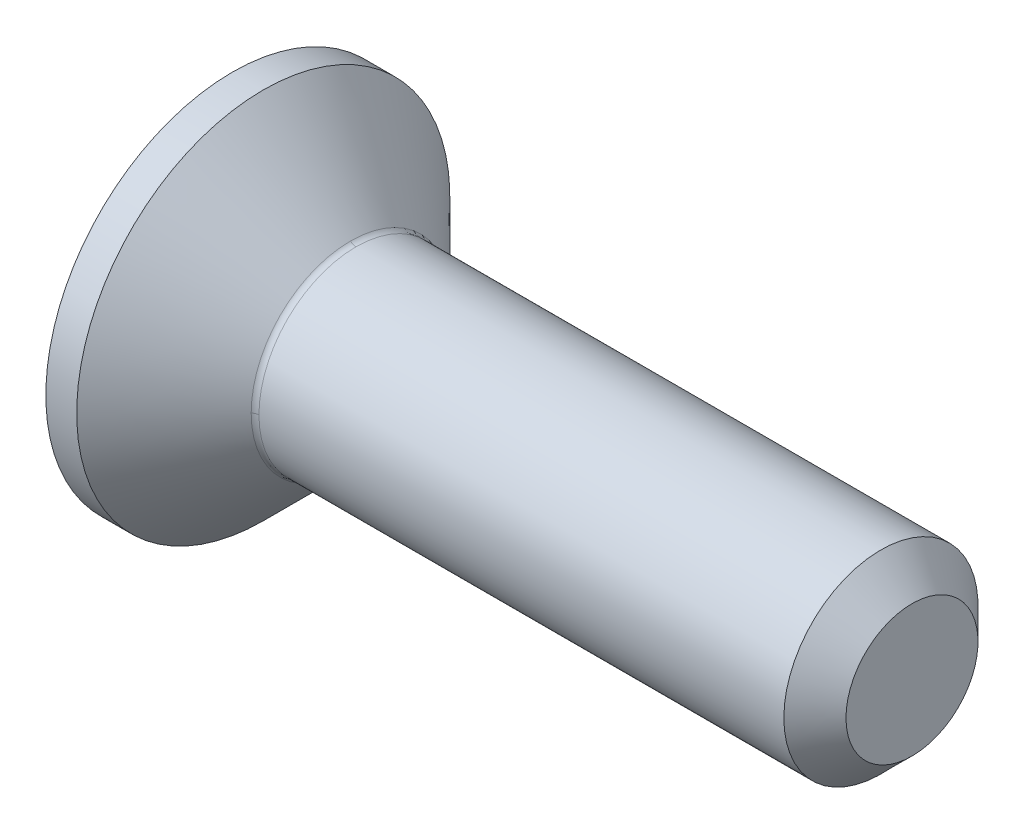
ISO-10303-21;
HEADER;
FILE_DESCRIPTION(('STEP AP214'),'2;1');
FILE_NAME('part.step','',(''),(''),'','','');
FILE_SCHEMA(('AUTOMOTIVE_DESIGN { 1 0 10303 214 1 1 1 1 }'));
ENDSEC;
DATA;
#1=APPLICATION_CONTEXT('core data for automotive mechanical design processes');
#2=APPLICATION_PROTOCOL_DEFINITION('international standard','automotive_design',2000,#1);
#3=PRODUCT_CONTEXT('',#1,'mechanical');
#4=PRODUCT('Part','Part','',(#3));
#5=PRODUCT_RELATED_PRODUCT_CATEGORY('part','',(#4));
#6=PRODUCT_DEFINITION_FORMATION('','',#4);
#7=PRODUCT_DEFINITION_CONTEXT('part definition',#1,'design');
#8=PRODUCT_DEFINITION('design','',#6,#7);
#9=PRODUCT_DEFINITION_SHAPE('','',#8);
#10=(LENGTH_UNIT() NAMED_UNIT(*) SI_UNIT(.MILLI.,.METRE.));
#11=(NAMED_UNIT(*) PLANE_ANGLE_UNIT() SI_UNIT($,.RADIAN.));
#12=(NAMED_UNIT(*) SI_UNIT($,.STERADIAN.) SOLID_ANGLE_UNIT());
#13=UNCERTAINTY_MEASURE_WITH_UNIT(LENGTH_MEASURE(1.E-05),#10,'distance_accuracy_value','');
#14=(GEOMETRIC_REPRESENTATION_CONTEXT(3) GLOBAL_UNCERTAINTY_ASSIGNED_CONTEXT((#13)) GLOBAL_UNIT_ASSIGNED_CONTEXT((#10,
#11,#12)) REPRESENTATION_CONTEXT('',''));
#15=CARTESIAN_POINT('',(0.,0.,0.));
#16=DIRECTION('',(0.,0.,1.));
#17=DIRECTION('',(1.,0.,0.));
#18=AXIS2_PLACEMENT_3D('',#15,#16,#17);
#19=CARTESIAN_POINT('',(34.170556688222,0.200123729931,0.299374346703));
#20=DIRECTION('',(1.,0.,0.));
#21=DIRECTION('',(0.,1.,0.));
#22=AXIS2_PLACEMENT_3D('',#19,#20,#21);
#23=PLANE('',#22);
#24=CARTESIAN_POINT('',(34.170556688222,0.200123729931,0.299374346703));
#25=DIRECTION('',(1.,0.,0.));
#26=DIRECTION('',(0.,0.,1.));
#27=AXIS2_PLACEMENT_3D('',#24,#25,#26);
#28=CIRCLE('',#27,3.4);
#29=CARTESIAN_POINT('',(34.170556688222,0.200123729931,3.699374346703));
#30=VERTEX_POINT('',#29);
#31=EDGE_CURVE('E10',#30,#30,#28,.T.);
#32=ORIENTED_EDGE('',*,*,#31,.T.);
#33=EDGE_LOOP('',(#32));
#34=FACE_BOUND('',#33,.T.);
#35=ADVANCED_FACE('F16',(#34),#23,.T.);
#36=CARTESIAN_POINT('',(33.370556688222,0.200123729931,0.299374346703));
#37=DIRECTION('',(-1.,0.,0.));
#38=DIRECTION('',(0.,0.,-1.));
#39=AXIS2_PLACEMENT_3D('',#36,#37,#38);
#40=CONICAL_SURFACE('',#39,4.2,0.785398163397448);
#41=ORIENTED_EDGE('',*,*,#31,.F.);
#42=EDGE_LOOP('',(#41));
#43=FACE_BOUND('',#42,.T.);
#44=CARTESIAN_POINT('',(32.570556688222,0.200123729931,0.299374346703));
#45=DIRECTION('',(1.,0.,0.));
#46=DIRECTION('',(0.,0.,1.));
#47=AXIS2_PLACEMENT_3D('',#44,#45,#46);
#48=CIRCLE('',#47,5.);
#49=CARTESIAN_POINT('',(32.570556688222,0.200123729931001,5.299374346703));
#50=VERTEX_POINT('',#49);
#51=EDGE_CURVE('E26',#50,#50,#48,.T.);
#52=ORIENTED_EDGE('',*,*,#51,.T.);
#53=EDGE_LOOP('',(#52));
#54=FACE_BOUND('',#53,.T.);
#55=ADVANCED_FACE('F326',(#43,#54),#40,.T.);
#56=CARTESIAN_POINT('',(-0.829443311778,0.200123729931,0.299374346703));
#57=DIRECTION('',(1.,0.,0.));
#58=DIRECTION('',(0.,0.,1.));
#59=AXIS2_PLACEMENT_3D('',#56,#57,#58);
#60=CYLINDRICAL_SURFACE('',#59,5.);
#61=CARTESIAN_POINT('',(5.53624211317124,0.200123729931,0.299374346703));
#62=DIRECTION('',(-1.,0.,0.));
#63=DIRECTION('',(0.,1.,0.));
#64=AXIS2_PLACEMENT_3D('',#61,#62,#63);
#65=CIRCLE('',#64,5.);
#66=CARTESIAN_POINT('',(5.53624211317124,0.200123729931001,5.299374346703));
#67=VERTEX_POINT('',#66);
#68=CARTESIAN_POINT('',(5.53624211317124,5.200123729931,0.299374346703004));
#69=VERTEX_POINT('',#68);
#70=EDGE_CURVE('E115',#67,#69,#65,.T.);
#71=ORIENTED_EDGE('',*,*,#70,.F.);
#72=CARTESIAN_POINT('',(5.53624211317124,0.200123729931,0.299374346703));
#73=DIRECTION('',(-1.,0.,0.));
#74=DIRECTION('',(0.,0.,1.));
#75=AXIS2_PLACEMENT_3D('',#72,#73,#74);
#76=CIRCLE('',#75,5.);
#77=EDGE_CURVE('E100',#69,#67,#76,.T.);
#78=ORIENTED_EDGE('',*,*,#77,.F.);
#79=EDGE_LOOP('',(#71,#78));
#80=FACE_BOUND('',#79,.T.);
#81=ORIENTED_EDGE('',*,*,#51,.F.);
#82=EDGE_LOOP('',(#81));
#83=FACE_BOUND('',#82,.T.);
#84=ADVANCED_FACE('F121',(#80,#83),#60,.T.);
#85=CARTESIAN_POINT('',(5.53624211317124,0.200123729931,0.299374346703));
#86=DIRECTION('',(1.,0.,0.));
#87=DIRECTION('',(0.,0.159318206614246,0.987227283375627));
#88=AXIS2_PLACEMENT_3D('',#85,#86,#87);
#89=TOROIDAL_SURFACE('',#88,5.4,0.4);
#90=ORIENTED_EDGE('',*,*,#77,.T.);
#91=CARTESIAN_POINT('',(5.53624211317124,0.200123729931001,5.699374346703));
#92=DIRECTION('',(0.,1.,0.));
#93=DIRECTION('',(0.,0.,-1.));
#94=AXIS2_PLACEMENT_3D('',#91,#92,#93);
#95=CIRCLE('',#94,0.4);
#96=CARTESIAN_POINT('',(5.25339940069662,0.200123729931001,5.41653163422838));
#97=VERTEX_POINT('',#96);
#98=EDGE_CURVE('E104',#67,#97,#95,.T.);
#99=ORIENTED_EDGE('',*,*,#98,.T.);
#100=CARTESIAN_POINT('',(5.25339940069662,0.200123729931,0.299374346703));
#101=DIRECTION('',(-1.,0.,0.));
#102=DIRECTION('',(0.,0.,1.));
#103=AXIS2_PLACEMENT_3D('',#100,#101,#102);
#104=CIRCLE('',#103,5.11715728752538);
#105=CARTESIAN_POINT('',(5.25339940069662,5.31728101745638,0.299374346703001));
#106=VERTEX_POINT('',#105);
#107=EDGE_CURVE('E131',#106,#97,#104,.T.);
#108=ORIENTED_EDGE('',*,*,#107,.F.);
#109=CARTESIAN_POINT('',(5.53624211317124,5.600123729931,0.299374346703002));
#110=DIRECTION('',(0.,0.,-1.));
#111=DIRECTION('',(0.,-1.,0.));
#112=AXIS2_PLACEMENT_3D('',#109,#110,#111);
#113=CIRCLE('',#112,0.4);
#114=EDGE_CURVE('E107',#69,#106,#113,.T.);
#115=ORIENTED_EDGE('',*,*,#114,.F.);
#116=EDGE_LOOP('',(#90,#99,#108,#115));
#117=FACE_BOUND('',#116,.T.);
#118=ADVANCED_FACE('F102',(#117),#89,.F.);
#119=CARTESIAN_POINT('',(5.53624211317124,0.200123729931,0.299374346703));
#120=DIRECTION('',(1.,0.,0.));
#121=DIRECTION('',(0.,0.987227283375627,-0.159318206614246));
#122=AXIS2_PLACEMENT_3D('',#119,#120,#121);
#123=TOROIDAL_SURFACE('',#122,5.4,0.4);
#124=ORIENTED_EDGE('',*,*,#70,.T.);
#125=ORIENTED_EDGE('',*,*,#114,.T.);
#126=CARTESIAN_POINT('',(5.25339940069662,0.200123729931,0.299374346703));
#127=DIRECTION('',(-1.,0.,0.));
#128=DIRECTION('',(0.,1.,0.));
#129=AXIS2_PLACEMENT_3D('',#126,#127,#128);
#130=CIRCLE('',#129,5.11715728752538);
#131=EDGE_CURVE('E117',#97,#106,#130,.T.);
#132=ORIENTED_EDGE('',*,*,#131,.F.);
#133=ORIENTED_EDGE('',*,*,#98,.F.);
#134=EDGE_LOOP('',(#124,#125,#132,#133));
#135=FACE_BOUND('',#134,.T.);
#136=ADVANCED_FACE('F114',(#135),#123,.F.);
#137=CARTESIAN_POINT('',(3.00697804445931,0.200123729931,0.299374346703));
#138=DIRECTION('',(-1.,0.,0.));
#139=DIRECTION('',(0.,-1.,0.));
#140=AXIS2_PLACEMENT_3D('',#137,#138,#139);
#141=CONICAL_SURFACE('',#140,7.36357864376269,0.785398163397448);
#142=ORIENTED_EDGE('',*,*,#107,.T.);
#143=ORIENTED_EDGE('',*,*,#131,.T.);
#144=EDGE_LOOP('',(#142,#143));
#145=FACE_BOUND('',#144,.T.);
#146=CARTESIAN_POINT('',(0.760556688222,0.200123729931,0.299374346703));
#147=DIRECTION('',(1.,0.,0.));
#148=DIRECTION('',(0.,1.,0.));
#149=AXIS2_PLACEMENT_3D('',#146,#147,#148);
#150=CIRCLE('',#149,9.61);
#151=CARTESIAN_POINT('',(0.760556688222,9.810123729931,0.299374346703));
#152=VERTEX_POINT('',#151);
#153=EDGE_CURVE('E173',#152,#152,#150,.T.);
#154=ORIENTED_EDGE('',*,*,#153,.T.);
#155=EDGE_LOOP('',(#154));
#156=FACE_BOUND('',#155,.T.);
#157=ADVANCED_FACE('F18',(#145,#156),#141,.T.);
#158=CARTESIAN_POINT('',(-0.829443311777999,0.200123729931,0.299374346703));
#159=DIRECTION('',(1.,0.,0.));
#160=DIRECTION('',(0.,1.,0.));
#161=AXIS2_PLACEMENT_3D('',#158,#159,#160);
#162=CYLINDRICAL_SURFACE('',#161,9.61);
#163=ORIENTED_EDGE('',*,*,#153,.F.);
#164=EDGE_LOOP('',(#163));
#165=FACE_BOUND('',#164,.T.);
#166=CARTESIAN_POINT('',(-0.829443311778,0.200123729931,0.299374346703));
#167=DIRECTION('',(1.,0.,0.));
#168=DIRECTION('',(0.,1.,0.));
#169=AXIS2_PLACEMENT_3D('',#166,#167,#168);
#170=CIRCLE('',#169,9.61);
#171=CARTESIAN_POINT('',(-0.829443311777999,9.810123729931,0.299374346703));
#172=VERTEX_POINT('',#171);
#173=EDGE_CURVE('E204',#172,#172,#170,.T.);
#174=ORIENTED_EDGE('',*,*,#173,.T.);
#175=EDGE_LOOP('',(#174));
#176=FACE_BOUND('',#175,.T.);
#177=ADVANCED_FACE('F335',(#165,#176),#162,.T.);
#178=CARTESIAN_POINT('',(-0.829443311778,-1.53192707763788,3.299374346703));
#179=DIRECTION('',(0.,-0.866025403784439,0.5));
#180=DIRECTION('',(-1.,0.,0.));
#181=AXIS2_PLACEMENT_3D('',#178,#179,#180);
#182=PLANE('',#181);
#183=CARTESIAN_POINT('',(2.77055668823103,-1.53192707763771,3.29937434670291));
#184=CARTESIAN_POINT('',(2.7795340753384,-1.54747645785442,3.27244203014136));
#185=CARTESIAN_POINT('',(2.79716354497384,-1.57863959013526,3.21846590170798));
#186=CARTESIAN_POINT('',(2.8225701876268,-1.62557234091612,3.13717599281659));
#187=CARTESIAN_POINT('',(2.84688725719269,-1.67270714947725,3.05553610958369));
#188=CARTESIAN_POINT('',(2.87005453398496,-1.72004798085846,2.97353938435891));
#189=CARTESIAN_POINT('',(2.89202858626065,-1.76763856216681,2.89111007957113));
#190=CARTESIAN_POINT('',(2.9127460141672,-1.81548983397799,2.80822924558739));
#191=CARTESIAN_POINT('',(2.93215448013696,-1.86364725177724,2.72481815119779));
#192=CARTESIAN_POINT('',(2.95016594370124,-1.91207333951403,2.6409417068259));
#193=CARTESIAN_POINT('',(2.96671895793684,-1.96079575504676,2.55655200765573));
#194=CARTESIAN_POINT('',(2.98173462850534,-2.00979247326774,2.47168720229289));
#195=CARTESIAN_POINT('',(2.9951549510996,-2.05910965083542,2.38626734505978));
#196=CARTESIAN_POINT('',(3.00689555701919,-2.10869434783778,2.30038413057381));
#197=CARTESIAN_POINT('',(3.0172639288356,-2.16039919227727,2.21082871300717));
#198=CARTESIAN_POINT('',(3.02624548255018,-2.21603775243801,2.11445989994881));
#199=CARTESIAN_POINT('',(3.03343546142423,-2.27731481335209,2.00832491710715));
#200=CARTESIAN_POINT('',(3.03763135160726,-2.33859628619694,1.90218229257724));
#201=CARTESIAN_POINT('',(3.03858019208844,-2.38287094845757,1.82549632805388));
#202=CARTESIAN_POINT('',(3.0384050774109,-2.42658884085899,1.74977471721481));
#203=CARTESIAN_POINT('',(3.03685907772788,-2.47332484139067,1.66882558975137));
#204=CARTESIAN_POINT('',(3.03156125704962,-2.53725275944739,1.55809918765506));
#205=CARTESIAN_POINT('',(3.02341417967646,-2.59943699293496,1.45039293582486));
#206=CARTESIAN_POINT('',(3.01183127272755,-2.66499191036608,1.33684848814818));
#207=CARTESIAN_POINT('',(2.99622176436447,-2.733976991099,1.21736282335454));
#208=CARTESIAN_POINT('',(2.97607510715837,-2.80622696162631,1.09222220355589));
#209=CARTESIAN_POINT('',(2.95560801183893,-2.86863549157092,0.984127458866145));
#210=CARTESIAN_POINT('',(2.93669321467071,-2.92028559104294,0.894666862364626));
#211=CARTESIAN_POINT('',(2.92096003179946,-2.96023562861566,0.825471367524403));
#212=CARTESIAN_POINT('',(2.90579744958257,-2.99656564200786,0.762545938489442));
#213=CARTESIAN_POINT('',(2.8907269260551,-3.03092290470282,0.703037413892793));
#214=CARTESIAN_POINT('',(2.87507433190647,-3.0650057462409,0.644004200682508));
#215=CARTESIAN_POINT('',(2.85890425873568,-3.09875204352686,0.585553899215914));
#216=CARTESIAN_POINT('',(2.84221846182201,-3.13223098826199,0.527566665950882));
#217=CARTESIAN_POINT('',(2.82504583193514,-3.16544781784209,0.470033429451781));
#218=CARTESIAN_POINT('',(2.80737998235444,-3.19846984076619,0.412837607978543));
#219=CARTESIAN_POINT('',(2.78924614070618,-3.23129921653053,0.355975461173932));
#220=CARTESIAN_POINT('',(2.77683523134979,-3.25310310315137,0.318210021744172));
#221=CARTESIAN_POINT('',(2.77055668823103,-3.26397788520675,0.299374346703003));
#222=(BOUNDED_CURVE() B_SPLINE_CURVE(3,(#183,#184,#185,#186,#187,#188,#189,#190,#191,#192,#193,
#194,#195,#196,#197,#198,#199,#200,#201,#202,#203,#204,#205,#206,#207,#208,#209,#210,#211,#212,
#213,#214,#215,#216,#217,#218,#219,#220,#221),.UNSPECIFIED.,.F.,
.F.) B_SPLINE_CURVE_WITH_KNOTS((4,1,1,1,1,1,1,1,1,1,1,1,1,1,1,1,1,1,1,1,1,1,1,1,1,1,1,1,1,1,1,1,
1,1,1,1,4),(-1.,-0.972330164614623,-0.944660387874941,-0.916985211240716,-0.889270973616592,
-0.861535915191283,-0.833705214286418,-0.805804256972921,-0.777791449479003,-0.74973638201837,
-0.721550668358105,-0.693273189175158,-0.664855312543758,-0.636378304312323,-0.604611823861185,
-0.569601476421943,-0.531628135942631,-0.499981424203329,-0.494063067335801,-0.457047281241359,
-0.420256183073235,-0.384948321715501,-0.350777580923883,-0.308024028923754,-0.266533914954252,
-0.226316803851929,-0.200128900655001,-0.176958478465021,-0.156864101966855,-0.136830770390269,
-0.116972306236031,-0.0972281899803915,-0.0776517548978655,-0.0581269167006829,
-0.0387049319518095,-0.0193298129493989,0.),
.UNSPECIFIED.) CURVE() GEOMETRIC_REPRESENTATION_ITEM() RATIONAL_B_SPLINE_CURVE((1.,1.,1.,1.,1.,
1.,1.,1.,1.,1.,1.,1.,1.,1.,1.,1.,1.,1.,1.,1.,1.,1.,1.,1.,1.,1.,1.,1.,1.,1.,1.,1.,1.,1.,1.,1.,1.,
1.,1.)) REPRESENTATION_ITEM(''));
#223=CARTESIAN_POINT('',(2.77055668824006,-1.53192707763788,3.299374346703));
#224=VERTEX_POINT('',#223);
#225=CARTESIAN_POINT('',(2.77055668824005,-3.26397788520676,0.299374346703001));
#226=VERTEX_POINT('',#225);
#227=EDGE_CURVE('E156',#224,#226,#222,.T.);
#228=ORIENTED_EDGE('',*,*,#227,.T.);
#229=DIRECTION('',(1.,0.,0.));
#230=VECTOR('',#229,1.);
#231=CARTESIAN_POINT('',(-0.829443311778,-3.26397788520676,0.299374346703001));
#232=LINE('',#231,#230);
#233=CARTESIAN_POINT('',(-0.829443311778,-3.26397788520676,0.299374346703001));
#234=VERTEX_POINT('',#233);
#235=EDGE_CURVE('E178',#234,#226,#232,.T.);
#236=ORIENTED_EDGE('',*,*,#235,.F.);
#237=DIRECTION('',(0.,-0.5,-0.866025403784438));
#238=VECTOR('',#237,1.);
#239=CARTESIAN_POINT('',(-0.829443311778,-1.53192707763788,3.299374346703));
#240=LINE('',#239,#238);
#241=CARTESIAN_POINT('',(-0.829443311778,-1.53192707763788,3.299374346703));
#242=VERTEX_POINT('',#241);
#243=EDGE_CURVE('E20',#242,#234,#240,.T.);
#244=ORIENTED_EDGE('',*,*,#243,.F.);
#245=DIRECTION('',(1.,0.,0.));
#246=VECTOR('',#245,1.);
#247=CARTESIAN_POINT('',(-0.829443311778,-1.53192707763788,3.299374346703));
#248=LINE('',#247,#246);
#249=EDGE_CURVE('E162',#242,#224,#248,.T.);
#250=ORIENTED_EDGE('',*,*,#249,.T.);
#251=EDGE_LOOP('',(#228,#236,#244,#250));
#252=FACE_BOUND('',#251,.T.);
#253=ADVANCED_FACE('F271',(#252),#182,.F.);
#254=CARTESIAN_POINT('',(-0.829443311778,-3.26397788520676,0.299374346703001));
#255=DIRECTION('',(0.,-0.866025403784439,-0.5));
#256=DIRECTION('',(0.,0.5,-0.866025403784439));
#257=AXIS2_PLACEMENT_3D('',#254,#255,#256);
#258=PLANE('',#257);
#259=CARTESIAN_POINT('',(2.77055668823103,-3.26397788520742,0.299374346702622));
#260=CARTESIAN_POINT('',(2.77998384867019,-3.24764945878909,0.271092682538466));
#261=CARTESIAN_POINT('',(2.79846208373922,-3.21495239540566,0.214459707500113));
#262=CARTESIAN_POINT('',(2.82500942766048,-3.16574571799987,0.129231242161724));
#263=CARTESIAN_POINT('',(2.85029054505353,-3.11644176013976,0.043834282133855));
#264=CARTESIAN_POINT('',(2.87424626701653,-3.06703737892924,-0.041736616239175));
#265=CARTESIAN_POINT('',(2.89680824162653,-3.01754808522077,-0.127454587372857));
#266=CARTESIAN_POINT('',(2.91792033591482,-2.96796410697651,-0.213336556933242));
#267=CARTESIAN_POINT('',(2.93751667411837,-2.91830038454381,-0.299356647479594));
#268=CARTESIAN_POINT('',(2.95554604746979,-2.86853781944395,-0.385547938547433));
#269=CARTESIAN_POINT('',(2.97194463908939,-2.8186937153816,-0.471880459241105));
#270=CARTESIAN_POINT('',(2.98665545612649,-2.76877741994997,-0.558338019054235));
#271=CARTESIAN_POINT('',(2.99961776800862,-2.71883271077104,-0.644844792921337));
#272=CARTESIAN_POINT('',(3.01079015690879,-2.66885843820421,-0.73140277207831));
#273=CARTESIAN_POINT('',(3.02012769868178,-2.61889559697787,-0.81794095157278));
#274=CARTESIAN_POINT('',(3.02760388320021,-2.56893266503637,-0.9044792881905));
#275=CARTESIAN_POINT('',(3.03319108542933,-2.51900931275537,-0.99094907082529));
#276=CARTESIAN_POINT('',(3.03687389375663,-2.46914097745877,-1.07732356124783));
#277=CARTESIAN_POINT('',(3.03831077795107,-2.42879280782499,-1.14720864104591));
#278=CARTESIAN_POINT('',(3.0385817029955,-2.39586081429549,-1.20424852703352));
#279=CARTESIAN_POINT('',(3.03823552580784,-2.3633320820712,-1.26058994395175));
#280=CARTESIAN_POINT('',(3.03658776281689,-2.32210694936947,-1.33199396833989));
#281=CARTESIAN_POINT('',(3.03293176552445,-2.27449911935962,-1.41445314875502));
#282=CARTESIAN_POINT('',(3.02752912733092,-2.22656783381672,-1.49747257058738));
#283=CARTESIAN_POINT('',(3.02011429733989,-2.17683751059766,-1.58360801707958));
#284=CARTESIAN_POINT('',(3.00918518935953,-2.11847944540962,-1.68468715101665));
#285=CARTESIAN_POINT('',(2.99395687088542,-2.05321290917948,-1.79773210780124));
#286=CARTESIAN_POINT('',(2.97399520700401,-1.98298195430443,-1.91937568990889));
#287=CARTESIAN_POINT('',(2.95385264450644,-1.92227600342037,-2.02452148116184));
#288=CARTESIAN_POINT('',(2.93529093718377,-1.87196406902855,-2.11166430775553));
#289=CARTESIAN_POINT('',(2.91984008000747,-1.83292778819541,-2.17927712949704));
#290=CARTESIAN_POINT('',(2.90493050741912,-1.79732735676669,-2.24093888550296));
#291=CARTESIAN_POINT('',(2.89007743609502,-1.76354506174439,-2.29945153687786));
#292=CARTESIAN_POINT('',(2.87462225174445,-1.72994229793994,-2.3576532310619));
#293=CARTESIAN_POINT('',(2.85860808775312,-1.69655119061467,-2.41548832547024));
#294=CARTESIAN_POINT('',(2.84204457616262,-1.6633341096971,-2.47302199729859));
#295=CARTESIAN_POINT('',(2.8249552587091,-1.6302865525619,-2.53026204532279));
#296=CARTESIAN_POINT('',(2.80734541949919,-1.59737229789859,-2.58727120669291));
#297=CARTESIAN_POINT('',(2.78923696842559,-1.56458962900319,-2.64405245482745));
#298=CARTESIAN_POINT('',(2.77683504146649,-1.54280153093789,-2.68179054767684));
#299=CARTESIAN_POINT('',(2.77055668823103,-1.53192707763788,-2.700625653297));
#300=(BOUNDED_CURVE() B_SPLINE_CURVE(3,(#259,#260,#261,#262,#263,#264,#265,#266,#267,#268,#269,
#270,#271,#272,#273,#274,#275,#276,#277,#278,#279,#280,#281,#282,#283,#284,#285,#286,#287,#288,
#289,#290,#291,#292,#293,#294,#295,#296,#297,#298,#299),.UNSPECIFIED.,.F.,
.F.) B_SPLINE_CURVE_WITH_KNOTS((4,1,1,1,1,1,1,1,1,1,1,1,1,1,1,1,1,1,1,1,1,1,1,1,1,1,1,1,1,1,1,1,
1,1,1,1,1,1,4),(-1.,-0.970940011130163,-0.941935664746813,-0.912980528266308,-0.884091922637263,
-0.85523470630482,-0.826435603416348,-0.797668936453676,-0.768942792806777,-0.740225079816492,
-0.711553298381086,-0.682914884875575,-0.654336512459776,-0.625777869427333,-0.597298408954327,
-0.568839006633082,-0.540446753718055,-0.512139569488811,-0.499984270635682,-0.484259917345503,
-0.456644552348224,-0.429649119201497,-0.403001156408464,-0.374772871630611,-0.34460691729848,
-0.303040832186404,-0.262696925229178,-0.223581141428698,-0.19805700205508,-0.175420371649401,
-0.155703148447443,-0.136019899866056,-0.116430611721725,-0.0969018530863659,
-0.0774601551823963,-0.0580433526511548,-0.0386758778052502,-0.0193286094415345,0.),
.UNSPECIFIED.) CURVE() GEOMETRIC_REPRESENTATION_ITEM() RATIONAL_B_SPLINE_CURVE((1.,1.,1.,1.,1.,
1.,1.,1.,1.,1.,1.,1.,1.,1.,1.,1.,1.,1.,1.,1.,1.,1.,1.,1.,1.,1.,1.,1.,1.,1.,1.,1.,1.,1.,1.,1.,1.,
1.,1.,1.,1.)) REPRESENTATION_ITEM(''));
#301=CARTESIAN_POINT('',(2.77055668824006,-1.53192707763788,-2.700625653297));
#302=VERTEX_POINT('',#301);
#303=EDGE_CURVE('E151',#226,#302,#300,.T.);
#304=ORIENTED_EDGE('',*,*,#303,.T.);
#305=DIRECTION('',(1.,0.,0.));
#306=VECTOR('',#305,1.);
#307=CARTESIAN_POINT('',(-0.829443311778,-1.53192707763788,-2.700625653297));
#308=LINE('',#307,#306);
#309=CARTESIAN_POINT('',(-0.829443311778,-1.53192707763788,-2.700625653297));
#310=VERTEX_POINT('',#309);
#311=EDGE_CURVE('E174',#310,#302,#308,.T.);
#312=ORIENTED_EDGE('',*,*,#311,.F.);
#313=DIRECTION('',(0.,0.5,-0.866025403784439));
#314=VECTOR('',#313,1.);
#315=CARTESIAN_POINT('',(-0.829443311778,-3.26397788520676,0.299374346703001));
#316=LINE('',#315,#314);
#317=EDGE_CURVE('E203',#234,#310,#316,.T.);
#318=ORIENTED_EDGE('',*,*,#317,.F.);
#319=ORIENTED_EDGE('',*,*,#235,.T.);
#320=EDGE_LOOP('',(#304,#312,#318,#319));
#321=FACE_BOUND('',#320,.T.);
#322=ADVANCED_FACE('F278',(#321),#258,.F.);
#323=CARTESIAN_POINT('',(-0.829443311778,-1.53192707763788,-2.700625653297));
#324=DIRECTION('',(0.,0.,-1.));
#325=DIRECTION('',(0.,-1.,0.));
#326=AXIS2_PLACEMENT_3D('',#323,#324,#325);
#327=PLANE('',#326);
#328=CARTESIAN_POINT('',(2.77055668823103,-1.53192707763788,-2.70062565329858));
#329=CARTESIAN_POINT('',(2.7799838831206,-1.49927022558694,-2.70062565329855));
#330=CARTESIAN_POINT('',(2.789714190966,-1.46483477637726,-2.70062565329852));
#331=CARTESIAN_POINT('',(2.80778990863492,-1.39929696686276,-2.70062565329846));
#332=CARTESIAN_POINT('',(2.82545065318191,-1.33374179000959,-2.7006256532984));
#333=CARTESIAN_POINT('',(2.85029054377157,-1.23685482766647,-2.70062565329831));
#334=CARTESIAN_POINT('',(2.86851122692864,-1.16170104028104,-2.70062565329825));
#335=CARTESIAN_POINT('',(2.8838893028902,-1.09574242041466,-2.7006256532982));
#336=CARTESIAN_POINT('',(2.8987871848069,-1.02977195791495,-2.70062565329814));
#337=CARTESIAN_POINT('',(2.91792033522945,-0.93989952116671,-2.70062565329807));
#338=CARTESIAN_POINT('',(2.93751667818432,-0.84057207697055,-2.70062565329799));
#339=CARTESIAN_POINT('',(2.95130067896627,-0.764482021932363,-2.70062565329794));
#340=CARTESIAN_POINT('',(2.96261921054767,-0.698048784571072,-2.70062565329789));
#341=CARTESIAN_POINT('',(2.9733840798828,-0.631590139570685,-2.70062565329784));
#342=CARTESIAN_POINT('',(2.98665546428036,-0.541526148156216,-2.70062565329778));
#343=CARTESIAN_POINT('',(2.99751520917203,-0.457839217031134,-2.70062565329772));
#344=CARTESIAN_POINT('',(3.00525577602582,-0.39119918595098,-2.70062565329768));
#345=CARTESIAN_POINT('',(3.01238756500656,-0.324593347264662,-2.70062565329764));
#346=CARTESIAN_POINT('',(3.0201277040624,-0.241762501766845,-2.70062565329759));
#347=CARTESIAN_POINT('',(3.02760388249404,-0.141836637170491,-2.70062565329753));
#348=CARTESIAN_POINT('',(3.0329296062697,-0.046662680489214,-2.70062565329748));
#349=CARTESIAN_POINT('',(3.03547701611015,0.019916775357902,-2.70062565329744));
#350=CARTESIAN_POINT('',(3.03738305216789,0.086341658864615,-2.70062565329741));
#351=CARTESIAN_POINT('',(3.0383107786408,0.138443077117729,-2.70062565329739));
#352=CARTESIAN_POINT('',(3.03858170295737,0.20430706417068,-2.70062565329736));
#353=CARTESIAN_POINT('',(3.03823552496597,0.269364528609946,-2.70062565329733));
#354=CARTESIAN_POINT('',(3.0365877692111,0.351814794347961,-2.70062565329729));
#355=CARTESIAN_POINT('',(3.03361889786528,0.429134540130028,-2.70062565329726));
#356=CARTESIAN_POINT('',(3.03039974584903,0.491958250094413,-2.70062565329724));
#357=CARTESIAN_POINT('',(3.02653729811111,0.55619690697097,-2.70062565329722));
#358=CARTESIAN_POINT('',(3.02011432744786,0.642353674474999,-2.70062565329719));
#359=CARTESIAN_POINT('',(3.01295385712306,0.71882206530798,-2.70062565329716));
#360=CARTESIAN_POINT('',(3.00412229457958,0.802468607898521,-2.70062565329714));
#361=CARTESIAN_POINT('',(2.99278636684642,0.897838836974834,-2.70062565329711));
#362=CARTESIAN_POINT('',(2.97407695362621,1.02948960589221,-2.70062565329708));
#363=CARTESIAN_POINT('',(2.95884490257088,1.12138534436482,-2.70062565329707));
#364=CARTESIAN_POINT('',(2.94563900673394,1.19600311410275,-2.70062565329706));
#365=CARTESIAN_POINT('',(2.93529094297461,1.25210055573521,-2.70062565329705));
#366=CARTESIAN_POINT('',(2.91984007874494,1.33017311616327,-2.70062565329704));
#367=CARTESIAN_POINT('',(2.90493050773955,1.40137397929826,-2.700625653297));
#368=CARTESIAN_POINT('',(2.89007743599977,1.46893856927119,-2.700625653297));
#369=CARTESIAN_POINT('',(2.87462225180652,1.5361440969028,-2.700625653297));
#370=CARTESIAN_POINT('',(2.85860808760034,1.60292631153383,-2.700625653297));
#371=CARTESIAN_POINT('',(2.84677508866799,1.6503869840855,-2.700625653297));
#372=CARTESIAN_POINT('',(2.83553381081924,1.69454168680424,-2.700625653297));
#373=CARTESIAN_POINT('',(2.82412477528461,1.73856007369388,-2.700625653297));
#374=CARTESIAN_POINT('',(2.80734541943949,1.80128409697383,-2.700625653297));
#375=CARTESIAN_POINT('',(2.78923696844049,1.86684943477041,-2.700625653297));
#376=CARTESIAN_POINT('',(2.77683504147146,1.91042563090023,-2.700625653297));
#377=CARTESIAN_POINT('',(2.77055668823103,1.93217453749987,-2.700625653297));
#378=(BOUNDED_CURVE() B_SPLINE_CURVE(3,(#328,#329,#330,#331,#332,#333,#334,#335,#336,#337,#338,
#339,#340,#341,#342,#343,#344,#345,#346,#347,#348,#349,#350,#351,#352,#353,#354,#355,#356,#357,
#358,#359,#360,#361,#362,#363,#364,#365,#366,#367,#368,#369,#370,#371,#372,#373,#374,#375,#376,
#377),.UNSPECIFIED.,.F.,.F.) B_SPLINE_CURVE_WITH_KNOTS((4,1,1,1,1,1,1,1,1,1,1,1,1,1,1,1,1,1,1,1,
1,1,1,1,1,1,1,1,1,1,1,1,1,1,1,1,1,1,1,1,1,1,1,1,1,1,1,4),(-1.,-0.970940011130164,
-0.969424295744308,-0.941935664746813,-0.912980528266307,-0.884091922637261,-0.875991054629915,
-0.855234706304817,-0.826435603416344,-0.797668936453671,-0.768942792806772,-0.760524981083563,
-0.740225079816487,-0.71155329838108,-0.682914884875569,-0.668268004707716,-0.65433651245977,
-0.625777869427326,-0.59729840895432,-0.568839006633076,-0.544440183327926,-0.54044675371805,
-0.512139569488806,-0.499984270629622,-0.484259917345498,-0.456644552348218,-0.429649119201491,
-0.418273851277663,-0.40300115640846,-0.374772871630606,-0.344606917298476,-0.33751058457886,
-0.303040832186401,-0.262696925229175,-0.22407673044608,-0.223581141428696,-0.198057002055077,
-0.175420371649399,-0.155703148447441,-0.136019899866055,-0.116430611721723,-0.0969018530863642,
-0.077460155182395,-0.0747186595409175,-0.0580433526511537,-0.0386758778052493,
-0.0193286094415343,0.),
.UNSPECIFIED.) CURVE() GEOMETRIC_REPRESENTATION_ITEM() RATIONAL_B_SPLINE_CURVE((1.,1.,1.,1.,1.,
1.,1.,1.,1.,1.,1.,1.,1.,1.,1.,1.,1.,1.,1.,1.,1.,1.,1.,1.,1.,1.,1.,1.,1.,1.,1.,1.,1.,1.,1.,1.,1.,
1.,1.,1.,1.,1.,1.,1.,1.,1.,1.,1.,1.,1.)) REPRESENTATION_ITEM(''));
#379=CARTESIAN_POINT('',(2.77055668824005,1.93217453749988,-2.700625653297));
#380=VERTEX_POINT('',#379);
#381=EDGE_CURVE('E157',#302,#380,#378,.T.);
#382=ORIENTED_EDGE('',*,*,#381,.T.);
#383=DIRECTION('',(1.,0.,0.));
#384=VECTOR('',#383,1.);
#385=CARTESIAN_POINT('',(-0.829443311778,1.93217453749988,-2.700625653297));
#386=LINE('',#385,#384);
#387=CARTESIAN_POINT('',(-0.829443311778,1.93217453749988,-2.700625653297));
#388=VERTEX_POINT('',#387);
#389=EDGE_CURVE('E179',#388,#380,#386,.T.);
#390=ORIENTED_EDGE('',*,*,#389,.F.);
#391=DIRECTION('',(0.,1.,0.));
#392=VECTOR('',#391,1.);
#393=CARTESIAN_POINT('',(-0.829443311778,-1.53192707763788,-2.700625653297));
#394=LINE('',#393,#392);
#395=EDGE_CURVE('E170',#310,#388,#394,.T.);
#396=ORIENTED_EDGE('',*,*,#395,.F.);
#397=ORIENTED_EDGE('',*,*,#311,.T.);
#398=EDGE_LOOP('',(#382,#390,#396,#397));
#399=FACE_BOUND('',#398,.T.);
#400=ADVANCED_FACE('F313',(#399),#327,.F.);
#401=CARTESIAN_POINT('',(-0.829443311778,1.93217453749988,-2.700625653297));
#402=DIRECTION('',(0.,0.866025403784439,-0.5));
#403=DIRECTION('',(-1.,0.,0.));
#404=AXIS2_PLACEMENT_3D('',#401,#402,#403);
#405=PLANE('',#404);
#406=CARTESIAN_POINT('',(2.77055668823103,1.93217453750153,-2.70062565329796));
#407=CARTESIAN_POINT('',(2.77998384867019,1.94850296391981,-2.67234398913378));
#408=CARTESIAN_POINT('',(2.79846208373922,1.98120002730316,-2.61571101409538));
#409=CARTESIAN_POINT('',(2.82500942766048,2.03040670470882,-2.53048254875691));
#410=CARTESIAN_POINT('',(2.85029054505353,2.0797106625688,-2.44508558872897));
#411=CARTESIAN_POINT('',(2.87424626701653,2.12911504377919,-2.35951469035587));
#412=CARTESIAN_POINT('',(2.89680824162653,2.17860433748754,-2.27379671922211));
#413=CARTESIAN_POINT('',(2.91792033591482,2.22818831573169,-2.18791474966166));
#414=CARTESIAN_POINT('',(2.93751667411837,2.27785203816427,-2.10189465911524));
#415=CARTESIAN_POINT('',(2.95554604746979,2.32761460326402,-2.01570336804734));
#416=CARTESIAN_POINT('',(2.97194463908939,2.37745870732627,-1.9293708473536));
#417=CARTESIAN_POINT('',(2.98665545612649,2.42737500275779,-1.84291328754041));
#418=CARTESIAN_POINT('',(2.99961776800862,2.47731971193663,-1.75640651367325));
#419=CARTESIAN_POINT('',(3.01079015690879,2.52729398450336,-1.66984853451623));
#420=CARTESIAN_POINT('',(3.02012769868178,2.57725682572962,-1.58331035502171));
#421=CARTESIAN_POINT('',(3.02760388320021,2.62721975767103,-1.49677201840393));
#422=CARTESIAN_POINT('',(3.03319108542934,2.67714310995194,-1.4103022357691));
#423=CARTESIAN_POINT('',(3.03687389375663,2.72701144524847,-1.32392774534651));
#424=CARTESIAN_POINT('',(3.03831077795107,2.76735961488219,-1.25404266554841));
#425=CARTESIAN_POINT('',(3.0385817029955,2.80029160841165,-1.19700277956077));
#426=CARTESIAN_POINT('',(3.03823552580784,2.83282034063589,-1.14066136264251));
#427=CARTESIAN_POINT('',(3.03658776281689,2.87404547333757,-1.06925733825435));
#428=CARTESIAN_POINT('',(3.03293176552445,2.92165330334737,-0.98679815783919));
#429=CARTESIAN_POINT('',(3.02752912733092,2.96958458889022,-0.9037787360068));
#430=CARTESIAN_POINT('',(3.02011429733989,3.01931491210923,-0.81764328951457));
#431=CARTESIAN_POINT('',(3.00918518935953,3.07767297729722,-0.71656415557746));
#432=CARTESIAN_POINT('',(2.99395687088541,3.14293951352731,-0.603519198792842));
#433=CARTESIAN_POINT('',(2.973995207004,3.21317046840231,-0.481875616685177));
#434=CARTESIAN_POINT('',(2.95385264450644,3.27387641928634,-0.376729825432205));
#435=CARTESIAN_POINT('',(2.93529093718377,3.32418835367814,-0.2895869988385));
#436=CARTESIAN_POINT('',(2.91984008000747,3.36322463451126,-0.22197417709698));
#437=CARTESIAN_POINT('',(2.90493050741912,3.39882506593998,-0.160312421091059));
#438=CARTESIAN_POINT('',(2.89007743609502,3.43260736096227,-0.101799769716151));
#439=CARTESIAN_POINT('',(2.87462225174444,3.46621012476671,-0.04359807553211));
#440=CARTESIAN_POINT('',(2.85860808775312,3.49960123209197,0.014237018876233));
#441=CARTESIAN_POINT('',(2.84204457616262,3.53281831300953,0.071770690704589));
#442=CARTESIAN_POINT('',(2.82495525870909,3.56586587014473,0.129010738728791));
#443=CARTESIAN_POINT('',(2.80734541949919,3.59878012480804,0.186019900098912));
#444=CARTESIAN_POINT('',(2.78923696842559,3.63156279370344,0.24280114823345));
#445=CARTESIAN_POINT('',(2.77683504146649,3.65335089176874,0.280539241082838));
#446=CARTESIAN_POINT('',(2.77055668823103,3.66422534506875,0.299374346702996));
#447=(BOUNDED_CURVE() B_SPLINE_CURVE(3,(#406,#407,#408,#409,#410,#411,#412,#413,#414,#415,#416,
#417,#418,#419,#420,#421,#422,#423,#424,#425,#426,#427,#428,#429,#430,#431,#432,#433,#434,#435,
#436,#437,#438,#439,#440,#441,#442,#443,#444,#445,#446),.UNSPECIFIED.,.F.,
.F.) B_SPLINE_CURVE_WITH_KNOTS((4,1,1,1,1,1,1,1,1,1,1,1,1,1,1,1,1,1,1,1,1,1,1,1,1,1,1,1,1,1,1,1,
1,1,1,1,1,1,4),(-1.,-0.970940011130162,-0.941935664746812,-0.912980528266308,-0.884091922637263,
-0.855234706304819,-0.826435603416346,-0.797668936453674,-0.768942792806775,-0.74022507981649,
-0.711553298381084,-0.682914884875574,-0.654336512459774,-0.625777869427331,-0.597298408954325,
-0.56883900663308,-0.540446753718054,-0.51213956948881,-0.499984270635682,-0.484259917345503,
-0.456644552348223,-0.429649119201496,-0.403001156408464,-0.374772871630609,-0.344606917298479,
-0.303040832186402,-0.262696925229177,-0.223581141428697,-0.198057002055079,-0.1754203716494,
-0.155703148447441,-0.136019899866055,-0.116430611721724,-0.0969018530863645,
-0.0774601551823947,-0.0580433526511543,-0.0386758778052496,-0.019328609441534,0.),
.UNSPECIFIED.) CURVE() GEOMETRIC_REPRESENTATION_ITEM() RATIONAL_B_SPLINE_CURVE((1.,1.,1.,1.,1.,
1.,1.,1.,1.,1.,1.,1.,1.,1.,1.,1.,1.,1.,1.,1.,1.,1.,1.,1.,1.,1.,1.,1.,1.,1.,1.,1.,1.,1.,1.,1.,1.,
1.,1.,1.,1.)) REPRESENTATION_ITEM(''));
#448=CARTESIAN_POINT('',(2.77055668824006,3.66422534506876,0.299374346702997));
#449=VERTEX_POINT('',#448);
#450=EDGE_CURVE('E180',#380,#449,#447,.T.);
#451=ORIENTED_EDGE('',*,*,#450,.T.);
#452=DIRECTION('',(1.,0.,0.));
#453=VECTOR('',#452,1.);
#454=CARTESIAN_POINT('',(-0.829443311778,3.66422534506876,0.299374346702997));
#455=LINE('',#454,#453);
#456=CARTESIAN_POINT('',(-0.829443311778,3.66422534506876,0.299374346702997));
#457=VERTEX_POINT('',#456);
#458=EDGE_CURVE('E191',#457,#449,#455,.T.);
#459=ORIENTED_EDGE('',*,*,#458,.F.);
#460=DIRECTION('',(0.,0.5,0.866025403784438));
#461=VECTOR('',#460,1.);
#462=CARTESIAN_POINT('',(-0.829443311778,1.93217453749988,-2.700625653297));
#463=LINE('',#462,#461);
#464=EDGE_CURVE('E150',#388,#457,#463,.T.);
#465=ORIENTED_EDGE('',*,*,#464,.F.);
#466=ORIENTED_EDGE('',*,*,#389,.T.);
#467=EDGE_LOOP('',(#451,#459,#465,#466));
#468=FACE_BOUND('',#467,.T.);
#469=ADVANCED_FACE('F311',(#468),#405,.F.);
#470=CARTESIAN_POINT('',(-0.829443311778,3.66422534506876,0.299374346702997));
#471=DIRECTION('',(0.,0.866025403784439,0.5));
#472=DIRECTION('',(1.,0.,0.));
#473=AXIS2_PLACEMENT_3D('',#470,#471,#472);
#474=PLANE('',#473);
#475=CARTESIAN_POINT('',(2.77055668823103,3.66422534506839,0.299374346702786));
#476=CARTESIAN_POINT('',(2.77998384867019,3.64789691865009,0.327656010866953));
#477=CARTESIAN_POINT('',(2.79846208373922,3.61519985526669,0.384288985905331));
#478=CARTESIAN_POINT('',(2.82500942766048,3.56599317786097,0.469517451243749));
#479=CARTESIAN_POINT('',(2.85029054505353,3.51668922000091,0.55491441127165));
#480=CARTESIAN_POINT('',(2.87424626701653,3.46728483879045,0.640485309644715));
#481=CARTESIAN_POINT('',(2.89680824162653,3.41779554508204,0.726203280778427));
#482=CARTESIAN_POINT('',(2.91792033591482,3.36821156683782,0.812085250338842));
#483=CARTESIAN_POINT('',(2.93751667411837,3.31854784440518,0.898105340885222));
#484=CARTESIAN_POINT('',(2.95554604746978,3.26878527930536,0.984296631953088));
#485=CARTESIAN_POINT('',(2.97194463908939,3.21894117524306,1.07062915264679));
#486=CARTESIAN_POINT('',(2.98665545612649,3.16902487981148,1.15708671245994));
#487=CARTESIAN_POINT('',(2.99961776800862,3.11908017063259,1.24359348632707));
#488=CARTESIAN_POINT('',(3.01079015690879,3.06910589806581,1.33015146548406));
#489=CARTESIAN_POINT('',(3.02012769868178,3.0191430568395,1.41668964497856));
#490=CARTESIAN_POINT('',(3.02760388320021,2.96918012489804,1.5032279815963));
#491=CARTESIAN_POINT('',(3.03319108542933,2.91925677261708,1.58969776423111));
#492=CARTESIAN_POINT('',(3.03687389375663,2.86938843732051,1.67607225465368));
#493=CARTESIAN_POINT('',(3.03831077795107,2.82904026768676,1.74595733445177));
#494=CARTESIAN_POINT('',(3.0385817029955,2.79610827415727,1.80299722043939));
#495=CARTESIAN_POINT('',(3.03823552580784,2.763579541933,1.85933863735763));
#496=CARTESIAN_POINT('',(3.03658776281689,2.7223544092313,1.93074266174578));
#497=CARTESIAN_POINT('',(3.03293176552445,2.67474657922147,2.01320184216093));
#498=CARTESIAN_POINT('',(3.02752912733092,2.62681529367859,2.0962212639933));
#499=CARTESIAN_POINT('',(3.02011429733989,2.57708497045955,2.18235671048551));
#500=CARTESIAN_POINT('',(3.00918518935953,2.51872690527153,2.2834358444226));
#501=CARTESIAN_POINT('',(2.99395687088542,2.45346036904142,2.39648080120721));
#502=CARTESIAN_POINT('',(2.973995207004,2.38322941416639,2.51812438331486));
#503=CARTESIAN_POINT('',(2.95385264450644,2.32252346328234,2.62327017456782));
#504=CARTESIAN_POINT('',(2.93529093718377,2.27221152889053,2.71041300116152));
#505=CARTESIAN_POINT('',(2.91984008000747,2.2331752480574,2.77802582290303));
#506=CARTESIAN_POINT('',(2.90493050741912,2.19757481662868,2.83968757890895));
#507=CARTESIAN_POINT('',(2.89007743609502,2.16379252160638,2.89820023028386));
#508=CARTESIAN_POINT('',(2.87462225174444,2.13018975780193,2.9564019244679));
#509=CARTESIAN_POINT('',(2.85860808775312,2.09679865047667,3.01423701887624));
#510=CARTESIAN_POINT('',(2.84204457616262,2.0635815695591,3.07177069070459));
#511=CARTESIAN_POINT('',(2.82495525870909,2.0305340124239,3.12901073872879));
#512=CARTESIAN_POINT('',(2.80734541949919,1.99761975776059,3.18601990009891));
#513=CARTESIAN_POINT('',(2.78923696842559,1.96483708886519,3.24280114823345));
#514=CARTESIAN_POINT('',(2.77683504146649,1.94304899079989,3.28053924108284));
#515=CARTESIAN_POINT('',(2.77055668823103,1.93217453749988,3.299374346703));
#516=(BOUNDED_CURVE() B_SPLINE_CURVE(3,(#475,#476,#477,#478,#479,#480,#481,#482,#483,#484,#485,
#486,#487,#488,#489,#490,#491,#492,#493,#494,#495,#496,#497,#498,#499,#500,#501,#502,#503,#504,
#505,#506,#507,#508,#509,#510,#511,#512,#513,#514,#515),.UNSPECIFIED.,.F.,
.F.) B_SPLINE_CURVE_WITH_KNOTS((4,1,1,1,1,1,1,1,1,1,1,1,1,1,1,1,1,1,1,1,1,1,1,1,1,1,1,1,1,1,1,1,
1,1,1,1,1,1,4),(-1.,-0.970940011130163,-0.941935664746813,-0.912980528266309,-0.884091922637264,
-0.85523470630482,-0.826435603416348,-0.797668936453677,-0.768942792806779,-0.740225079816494,
-0.711553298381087,-0.682914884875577,-0.654336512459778,-0.625777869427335,-0.597298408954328,
-0.568839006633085,-0.540446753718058,-0.512139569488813,-0.499984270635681,-0.484259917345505,
-0.456644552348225,-0.429649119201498,-0.403001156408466,-0.374772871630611,-0.344606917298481,
-0.303040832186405,-0.262696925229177,-0.223581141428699,-0.19805700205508,-0.1754203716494,
-0.155703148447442,-0.136019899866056,-0.116430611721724,-0.0969018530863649,
-0.0774601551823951,-0.0580433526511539,-0.0386758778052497,-0.0193286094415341,0.),
.UNSPECIFIED.) CURVE() GEOMETRIC_REPRESENTATION_ITEM() RATIONAL_B_SPLINE_CURVE((1.,1.,1.,1.,1.,
1.,1.,1.,1.,1.,1.,1.,1.,1.,1.,1.,1.,1.,1.,1.,1.,1.,1.,1.,1.,1.,1.,1.,1.,1.,1.,1.,1.,1.,1.,1.,1.,
1.,1.,1.,1.)) REPRESENTATION_ITEM(''));
#517=CARTESIAN_POINT('',(2.77055668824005,1.93217453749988,3.299374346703));
#518=VERTEX_POINT('',#517);
#519=EDGE_CURVE('E141',#449,#518,#516,.T.);
#520=ORIENTED_EDGE('',*,*,#519,.T.);
#521=DIRECTION('',(1.,0.,0.));
#522=VECTOR('',#521,1.);
#523=CARTESIAN_POINT('',(-0.829443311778,1.93217453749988,3.299374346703));
#524=LINE('',#523,#522);
#525=CARTESIAN_POINT('',(-0.829443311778,1.93217453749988,3.299374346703));
#526=VERTEX_POINT('',#525);
#527=EDGE_CURVE('E165',#526,#518,#524,.T.);
#528=ORIENTED_EDGE('',*,*,#527,.F.);
#529=DIRECTION('',(0.,-0.5,0.866025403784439));
#530=VECTOR('',#529,1.);
#531=CARTESIAN_POINT('',(-0.829443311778,3.66422534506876,0.299374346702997));
#532=LINE('',#531,#530);
#533=EDGE_CURVE('E143',#457,#526,#532,.T.);
#534=ORIENTED_EDGE('',*,*,#533,.F.);
#535=ORIENTED_EDGE('',*,*,#458,.T.);
#536=EDGE_LOOP('',(#520,#528,#534,#535));
#537=FACE_BOUND('',#536,.T.);
#538=ADVANCED_FACE('F303',(#537),#474,.F.);
#539=CARTESIAN_POINT('',(-0.829443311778,1.93217453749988,3.299374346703));
#540=DIRECTION('',(0.,0.,1.));
#541=DIRECTION('',(0.,-1.,0.));
#542=AXIS2_PLACEMENT_3D('',#539,#540,#541);
#543=PLANE('',#542);
#544=CARTESIAN_POINT('',(3.03850588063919,0.200123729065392,3.299374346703));
#545=CARTESIAN_POINT('',(3.03850592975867,0.19155566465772,3.299374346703));
#546=CARTESIAN_POINT('',(3.0383127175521,0.113484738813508,3.299374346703));
#547=CARTESIAN_POINT('',(3.03593519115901,0.018564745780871,3.29937434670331));
#548=CARTESIAN_POINT('',(3.02878035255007,-0.125284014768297,3.29937434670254));
#549=CARTESIAN_POINT('',(3.01846942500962,-0.270572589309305,3.29937434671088));
#550=CARTESIAN_POINT('',(3.00368449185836,-0.409004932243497,3.29937434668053));
#551=CARTESIAN_POINT('',(2.98418694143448,-0.560744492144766,3.29937434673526));
#552=CARTESIAN_POINT('',(2.96533343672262,-0.686263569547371,3.29937434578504));
#553=CARTESIAN_POINT('',(2.93655450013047,-0.84683199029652,3.2993743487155));
#554=CARTESIAN_POINT('',(2.90711365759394,-0.99321360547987,3.29937433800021));
#555=CARTESIAN_POINT('',(2.8753135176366,-1.13463683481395,3.29937434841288));
#556=CARTESIAN_POINT('',(2.84000906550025,-1.27828520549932,3.29937434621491));
#557=CARTESIAN_POINT('',(2.80648332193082,-1.40524471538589,3.29937434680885));
#558=CARTESIAN_POINT('',(2.78193553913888,-1.49250880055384,3.29937434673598));
#559=CARTESIAN_POINT('',(2.77055668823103,-1.53192707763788,3.299374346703));
#560=(BOUNDED_CURVE() B_SPLINE_CURVE(3,(#544,#545,#546,#547,#548,#549,#550,#551,#552,#553,#554,
#555,#556,#557,#558,#559),.UNSPECIFIED.,.F.,.F.) B_SPLINE_CURVE_WITH_KNOTS((4,1,1,1,1,1,1,1,1,1,
1,1,1,4),(-1.,-0.985392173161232,-0.866888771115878,-0.838072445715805,-0.739680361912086,
-0.618405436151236,-0.600609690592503,-0.478698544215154,-0.401922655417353,-0.322337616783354,
-0.223989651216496,-0.154646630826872,-0.0700002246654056,0.),
.UNSPECIFIED.) CURVE() GEOMETRIC_REPRESENTATION_ITEM() RATIONAL_B_SPLINE_CURVE((1.,1.,1.,1.,1.,
1.,1.,1.,1.,1.,1.,1.,1.,1.,1.,1.)) REPRESENTATION_ITEM(''));
#561=CARTESIAN_POINT('',(3.03850588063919,0.200123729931,3.299374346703));
#562=VERTEX_POINT('',#561);
#563=EDGE_CURVE('E166',#562,#224,#560,.T.);
#564=ORIENTED_EDGE('',*,*,#563,.T.);
#565=ORIENTED_EDGE('',*,*,#249,.F.);
#566=DIRECTION('',(0.,-1.,0.));
#567=VECTOR('',#566,1.);
#568=CARTESIAN_POINT('',(-0.829443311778,1.93217453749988,3.299374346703));
#569=LINE('',#568,#567);
#570=EDGE_CURVE('E142',#526,#242,#569,.T.);
#571=ORIENTED_EDGE('',*,*,#570,.F.);
#572=ORIENTED_EDGE('',*,*,#527,.T.);
#573=CARTESIAN_POINT('',(2.77055668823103,1.93217453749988,3.299374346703));
#574=CARTESIAN_POINT('',(2.77566027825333,1.91449515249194,3.299374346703));
#575=CARTESIAN_POINT('',(2.78492823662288,1.88201748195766,3.299374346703));
#576=CARTESIAN_POINT('',(2.80316600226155,1.816678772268,3.299374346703));
#577=CARTESIAN_POINT('',(2.8223601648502,1.74554251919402,3.299374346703));
#578=CARTESIAN_POINT('',(2.83947268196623,1.67930146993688,3.299374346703));
#579=CARTESIAN_POINT('',(2.85924518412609,1.60063922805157,3.299374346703));
#580=CARTESIAN_POINT('',(2.88637379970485,1.4874579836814,3.299374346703));
#581=CARTESIAN_POINT('',(2.91033551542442,1.37683292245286,3.299374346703));
#582=CARTESIAN_POINT('',(2.93632589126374,1.24761707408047,3.299374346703));
#583=CARTESIAN_POINT('',(2.96279031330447,1.10399850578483,3.299374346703));
#584=CARTESIAN_POINT('',(2.98639435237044,0.946179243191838,3.299374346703));
#585=CARTESIAN_POINT('',(3.00481408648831,0.798307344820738,3.299374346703));
#586=CARTESIAN_POINT('',(3.0192943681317,0.659557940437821,3.299374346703));
#587=CARTESIAN_POINT('',(3.03006474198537,0.508527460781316,3.299374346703));
#588=CARTESIAN_POINT('',(3.03516662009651,0.392021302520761,3.299374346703));
#589=CARTESIAN_POINT('',(3.03781654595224,0.299839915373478,3.299374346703));
#590=CARTESIAN_POINT('',(3.03850666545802,0.239955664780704,3.299374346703));
#591=CARTESIAN_POINT('',(3.03850588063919,0.200123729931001,3.299374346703));
#592=(BOUNDED_CURVE() B_SPLINE_CURVE(3,(#573,#574,#575,#576,#577,#578,#579,#580,#581,#582,#583,
#584,#585,#586,#587,#588,#589,#590,#591),.UNSPECIFIED.,.F.,.F.) B_SPLINE_CURVE_WITH_KNOTS((4,1,
1,1,1,1,1,1,1,1,1,1,1,1,1,1,4),(-1.,-0.968594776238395,-0.942364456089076,-0.884255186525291,
-0.842903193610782,-0.8256654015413,-0.745906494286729,-0.644390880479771,-0.632587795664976,
-0.521047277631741,-0.395265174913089,-0.360431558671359,-0.266845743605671,-0.157295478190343,
-0.102116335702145,-0.0679040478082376,0.),
.UNSPECIFIED.) CURVE() GEOMETRIC_REPRESENTATION_ITEM() RATIONAL_B_SPLINE_CURVE((1.,1.,1.,1.,1.,
1.,1.,1.,1.,1.,1.,1.,1.,1.,1.,1.,1.,1.,1.)) REPRESENTATION_ITEM(''));
#593=EDGE_CURVE('E135',#518,#562,#592,.T.);
#594=ORIENTED_EDGE('',*,*,#593,.T.);
#595=EDGE_LOOP('',(#564,#565,#571,#572,#594));
#596=FACE_BOUND('',#595,.T.);
#597=ADVANCED_FACE('F306',(#596),#543,.F.);
#598=CARTESIAN_POINT('',(3.77055668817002,0.200123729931,0.299374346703));
#599=DIRECTION('',(-1.,0.,0.));
#600=DIRECTION('',(0.,0.,-1.));
#601=AXIS2_PLACEMENT_3D('',#598,#599,#600);
#602=CONICAL_SURFACE('',#601,1.73205080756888,1.04719755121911);
#603=CARTESIAN_POINT('',(4.77055668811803,0.200123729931,0.299374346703));
#604=VERTEX_POINT('',#603);
#605=VERTEX_LOOP('',#604);
#606=FACE_BOUND('',#605,.T.);
#607=ORIENTED_EDGE('',*,*,#593,.F.);
#608=ORIENTED_EDGE('',*,*,#519,.F.);
#609=ORIENTED_EDGE('',*,*,#450,.F.);
#610=ORIENTED_EDGE('',*,*,#381,.F.);
#611=ORIENTED_EDGE('',*,*,#303,.F.);
#612=ORIENTED_EDGE('',*,*,#227,.F.);
#613=ORIENTED_EDGE('',*,*,#563,.F.);
#614=EDGE_LOOP('',(#607,#608,#609,#610,#611,#612,#613));
#615=FACE_BOUND('',#614,.T.);
#616=ADVANCED_FACE('F276',(#606,#615),#602,.F.);
#617=CARTESIAN_POINT('',(-0.829443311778,0.200123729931,0.299374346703));
#618=DIRECTION('',(1.,0.,0.));
#619=DIRECTION('',(0.,1.,0.));
#620=AXIS2_PLACEMENT_3D('',#617,#618,#619);
#621=PLANE('',#620);
#622=ORIENTED_EDGE('',*,*,#243,.T.);
#623=ORIENTED_EDGE('',*,*,#317,.T.);
#624=ORIENTED_EDGE('',*,*,#395,.T.);
#625=ORIENTED_EDGE('',*,*,#464,.T.);
#626=ORIENTED_EDGE('',*,*,#533,.T.);
#627=ORIENTED_EDGE('',*,*,#570,.T.);
#628=EDGE_LOOP('',(#622,#623,#624,#625,#626,#627));
#629=FACE_BOUND('',#628,.T.);
#630=ORIENTED_EDGE('',*,*,#173,.F.);
#631=EDGE_LOOP('',(#630));
#632=FACE_BOUND('',#631,.T.);
#633=ADVANCED_FACE('F307',(#629,#632),#621,.F.);
#634=CLOSED_SHELL('',(#35,#55,#84,#118,#136,#157,#177,#253,#322,#400,#469,#538,#597,#616,#633));
#635=MANIFOLD_SOLID_BREP('B1',#634);
#636=ADVANCED_BREP_SHAPE_REPRESENTATION('',(#18,#635),#14);
#637=SHAPE_DEFINITION_REPRESENTATION(#9,#636);
ENDSEC;
END-ISO-10303-21;
